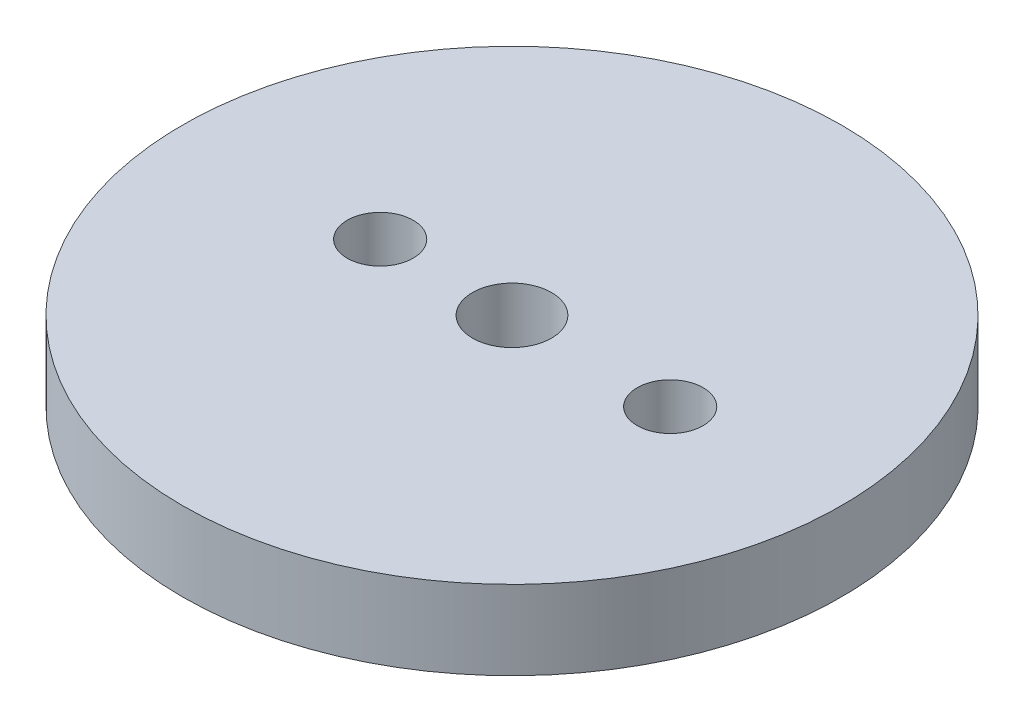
ISO-10303-21;
HEADER;
FILE_DESCRIPTION(('STEP AP214'),'2;1');
FILE_NAME('part.step','',(''),(''),'','','');
FILE_SCHEMA(('AUTOMOTIVE_DESIGN { 1 0 10303 214 1 1 1 1 }'));
ENDSEC;
DATA;
#1=APPLICATION_CONTEXT('core data for automotive mechanical design processes');
#2=APPLICATION_PROTOCOL_DEFINITION('international standard','automotive_design',2000,#1);
#3=PRODUCT_CONTEXT('',#1,'mechanical');
#4=PRODUCT('Part','Part','',(#3));
#5=PRODUCT_RELATED_PRODUCT_CATEGORY('part','',(#4));
#6=PRODUCT_DEFINITION_FORMATION('','',#4);
#7=PRODUCT_DEFINITION_CONTEXT('part definition',#1,'design');
#8=PRODUCT_DEFINITION('design','',#6,#7);
#9=PRODUCT_DEFINITION_SHAPE('','',#8);
#10=(LENGTH_UNIT() NAMED_UNIT(*) SI_UNIT(.MILLI.,.METRE.));
#11=(NAMED_UNIT(*) PLANE_ANGLE_UNIT() SI_UNIT($,.RADIAN.));
#12=(NAMED_UNIT(*) SI_UNIT($,.STERADIAN.) SOLID_ANGLE_UNIT());
#13=UNCERTAINTY_MEASURE_WITH_UNIT(LENGTH_MEASURE(1.E-05),#10,'distance_accuracy_value','');
#14=(GEOMETRIC_REPRESENTATION_CONTEXT(3) GLOBAL_UNCERTAINTY_ASSIGNED_CONTEXT((#13)) GLOBAL_UNIT_ASSIGNED_CONTEXT((#10,
#11,#12)) REPRESENTATION_CONTEXT('',''));
#15=CARTESIAN_POINT('',(0.,0.,0.));
#16=DIRECTION('',(0.,0.,1.));
#17=DIRECTION('',(1.,0.,0.));
#18=AXIS2_PLACEMENT_3D('',#15,#16,#17);
#19=CARTESIAN_POINT('',(0.,6.,0.));
#20=DIRECTION('',(0.,1.,0.));
#21=DIRECTION('',(0.,0.,1.));
#22=AXIS2_PLACEMENT_3D('',#19,#20,#21);
#23=PLANE('',#22);
#24=CARTESIAN_POINT('',(-10.,6.,0.));
#25=DIRECTION('',(0.,1.,0.));
#26=DIRECTION('',(0.,0.,1.));
#27=AXIS2_PLACEMENT_3D('',#24,#25,#26);
#28=CIRCLE('',#27,2.49999999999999);
#29=CARTESIAN_POINT('',(-10.,6.,2.49999999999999));
#30=VERTEX_POINT('',#29);
#31=EDGE_CURVE('E56',#30,#30,#28,.T.);
#32=ORIENTED_EDGE('',*,*,#31,.F.);
#33=EDGE_LOOP('',(#32));
#34=FACE_BOUND('',#33,.T.);
#35=CARTESIAN_POINT('',(12.,6.,0.));
#36=DIRECTION('',(0.,1.,0.));
#37=DIRECTION('',(0.,0.,1.));
#38=AXIS2_PLACEMENT_3D('',#35,#36,#37);
#39=CIRCLE('',#38,2.49999999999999);
#40=CARTESIAN_POINT('',(12.,6.,2.49999999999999));
#41=VERTEX_POINT('',#40);
#42=EDGE_CURVE('E50',#41,#41,#39,.T.);
#43=ORIENTED_EDGE('',*,*,#42,.F.);
#44=EDGE_LOOP('',(#43));
#45=FACE_BOUND('',#44,.T.);
#46=CARTESIAN_POINT('',(0.,6.,0.));
#47=DIRECTION('',(0.,1.,0.));
#48=DIRECTION('',(0.,0.,1.));
#49=AXIS2_PLACEMENT_3D('',#46,#47,#48);
#50=CIRCLE('',#49,25.);
#51=CARTESIAN_POINT('',(0.,6.,25.));
#52=VERTEX_POINT('',#51);
#53=EDGE_CURVE('E10',#52,#52,#50,.T.);
#54=ORIENTED_EDGE('',*,*,#53,.T.);
#55=EDGE_LOOP('',(#54));
#56=FACE_BOUND('',#55,.T.);
#57=CARTESIAN_POINT('',(0.,6.,0.));
#58=DIRECTION('',(0.,1.,0.));
#59=DIRECTION('',(0.,0.,1.));
#60=AXIS2_PLACEMENT_3D('',#57,#58,#59);
#61=CIRCLE('',#60,3.);
#62=CARTESIAN_POINT('',(0.,6.,3.));
#63=VERTEX_POINT('',#62);
#64=EDGE_CURVE('E40',#63,#63,#61,.T.);
#65=ORIENTED_EDGE('',*,*,#64,.F.);
#66=EDGE_LOOP('',(#65));
#67=FACE_BOUND('',#66,.T.);
#68=ADVANCED_FACE('F29',(#34,#45,#56,#67),#23,.T.);
#69=CARTESIAN_POINT('',(0.,0.,0.));
#70=DIRECTION('',(0.,1.,0.));
#71=DIRECTION('',(0.,0.,1.));
#72=AXIS2_PLACEMENT_3D('',#69,#70,#71);
#73=PLANE('',#72);
#74=CARTESIAN_POINT('',(-10.,0.,0.));
#75=DIRECTION('',(0.,1.,0.));
#76=DIRECTION('',(0.,0.,1.));
#77=AXIS2_PLACEMENT_3D('',#74,#75,#76);
#78=CIRCLE('',#77,2.5);
#79=CARTESIAN_POINT('',(-10.,0.,2.5));
#80=VERTEX_POINT('',#79);
#81=EDGE_CURVE('E53',#80,#80,#78,.T.);
#82=ORIENTED_EDGE('',*,*,#81,.T.);
#83=EDGE_LOOP('',(#82));
#84=FACE_BOUND('',#83,.T.);
#85=CARTESIAN_POINT('',(12.,0.,0.));
#86=DIRECTION('',(0.,1.,0.));
#87=DIRECTION('',(0.,0.,1.));
#88=AXIS2_PLACEMENT_3D('',#85,#86,#87);
#89=CIRCLE('',#88,2.5);
#90=CARTESIAN_POINT('',(12.,0.,2.5));
#91=VERTEX_POINT('',#90);
#92=EDGE_CURVE('E45',#91,#91,#89,.T.);
#93=ORIENTED_EDGE('',*,*,#92,.T.);
#94=EDGE_LOOP('',(#93));
#95=FACE_BOUND('',#94,.T.);
#96=CARTESIAN_POINT('',(0.,0.,0.));
#97=DIRECTION('',(0.,1.,0.));
#98=DIRECTION('',(0.,0.,1.));
#99=AXIS2_PLACEMENT_3D('',#96,#97,#98);
#100=CIRCLE('',#99,25.);
#101=CARTESIAN_POINT('',(0.,0.,25.));
#102=VERTEX_POINT('',#101);
#103=EDGE_CURVE('E33',#102,#102,#100,.T.);
#104=ORIENTED_EDGE('',*,*,#103,.F.);
#105=EDGE_LOOP('',(#104));
#106=FACE_BOUND('',#105,.T.);
#107=CARTESIAN_POINT('',(0.,0.,0.));
#108=DIRECTION('',(0.,1.,0.));
#109=DIRECTION('',(0.,0.,1.));
#110=AXIS2_PLACEMENT_3D('',#107,#108,#109);
#111=CIRCLE('',#110,3.);
#112=CARTESIAN_POINT('',(0.,0.,3.));
#113=VERTEX_POINT('',#112);
#114=EDGE_CURVE('E42',#113,#113,#111,.T.);
#115=ORIENTED_EDGE('',*,*,#114,.T.);
#116=EDGE_LOOP('',(#115));
#117=FACE_BOUND('',#116,.T.);
#118=ADVANCED_FACE('F64',(#84,#95,#106,#117),#73,.F.);
#119=CARTESIAN_POINT('',(0.,6.,0.));
#120=DIRECTION('',(0.,-1.,0.));
#121=DIRECTION('',(0.,0.,-1.));
#122=AXIS2_PLACEMENT_3D('',#119,#120,#121);
#123=CYLINDRICAL_SURFACE('',#122,25.);
#124=ORIENTED_EDGE('',*,*,#53,.F.);
#125=EDGE_LOOP('',(#124));
#126=FACE_BOUND('',#125,.T.);
#127=ORIENTED_EDGE('',*,*,#103,.T.);
#128=EDGE_LOOP('',(#127));
#129=FACE_BOUND('',#128,.T.);
#130=ADVANCED_FACE('F31',(#126,#129),#123,.T.);
#131=CARTESIAN_POINT('',(0.,6.,0.));
#132=DIRECTION('',(0.,-1.,0.));
#133=DIRECTION('',(0.,0.,-1.));
#134=AXIS2_PLACEMENT_3D('',#131,#132,#133);
#135=CYLINDRICAL_SURFACE('',#134,3.);
#136=ORIENTED_EDGE('',*,*,#64,.T.);
#137=EDGE_LOOP('',(#136));
#138=FACE_BOUND('',#137,.T.);
#139=ORIENTED_EDGE('',*,*,#114,.F.);
#140=EDGE_LOOP('',(#139));
#141=FACE_BOUND('',#140,.T.);
#142=ADVANCED_FACE('F70',(#138,#141),#135,.F.);
#143=CARTESIAN_POINT('',(12.,6.,0.));
#144=DIRECTION('',(0.,1.,0.));
#145=DIRECTION('',(0.,0.,1.));
#146=AXIS2_PLACEMENT_3D('',#143,#144,#145);
#147=CYLINDRICAL_SURFACE('',#146,2.49999999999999);
#148=ORIENTED_EDGE('',*,*,#92,.F.);
#149=EDGE_LOOP('',(#148));
#150=FACE_BOUND('',#149,.T.);
#151=ORIENTED_EDGE('',*,*,#42,.T.);
#152=EDGE_LOOP('',(#151));
#153=FACE_BOUND('',#152,.T.);
#154=ADVANCED_FACE('F73',(#150,#153),#147,.F.);
#155=CARTESIAN_POINT('',(-10.,6.,0.));
#156=DIRECTION('',(0.,1.,0.));
#157=DIRECTION('',(0.,0.,1.));
#158=AXIS2_PLACEMENT_3D('',#155,#156,#157);
#159=CYLINDRICAL_SURFACE('',#158,2.49999999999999);
#160=ORIENTED_EDGE('',*,*,#81,.F.);
#161=EDGE_LOOP('',(#160));
#162=FACE_BOUND('',#161,.T.);
#163=ORIENTED_EDGE('',*,*,#31,.T.);
#164=EDGE_LOOP('',(#163));
#165=FACE_BOUND('',#164,.T.);
#166=ADVANCED_FACE('F60',(#162,#165),#159,.F.);
#167=CLOSED_SHELL('',(#68,#118,#130,#142,#154,#166));
#168=MANIFOLD_SOLID_BREP('B2',#167);
#169=ADVANCED_BREP_SHAPE_REPRESENTATION('',(#18,#168),#14);
#170=SHAPE_DEFINITION_REPRESENTATION(#9,#169);
ENDSEC;
END-ISO-10303-21;
